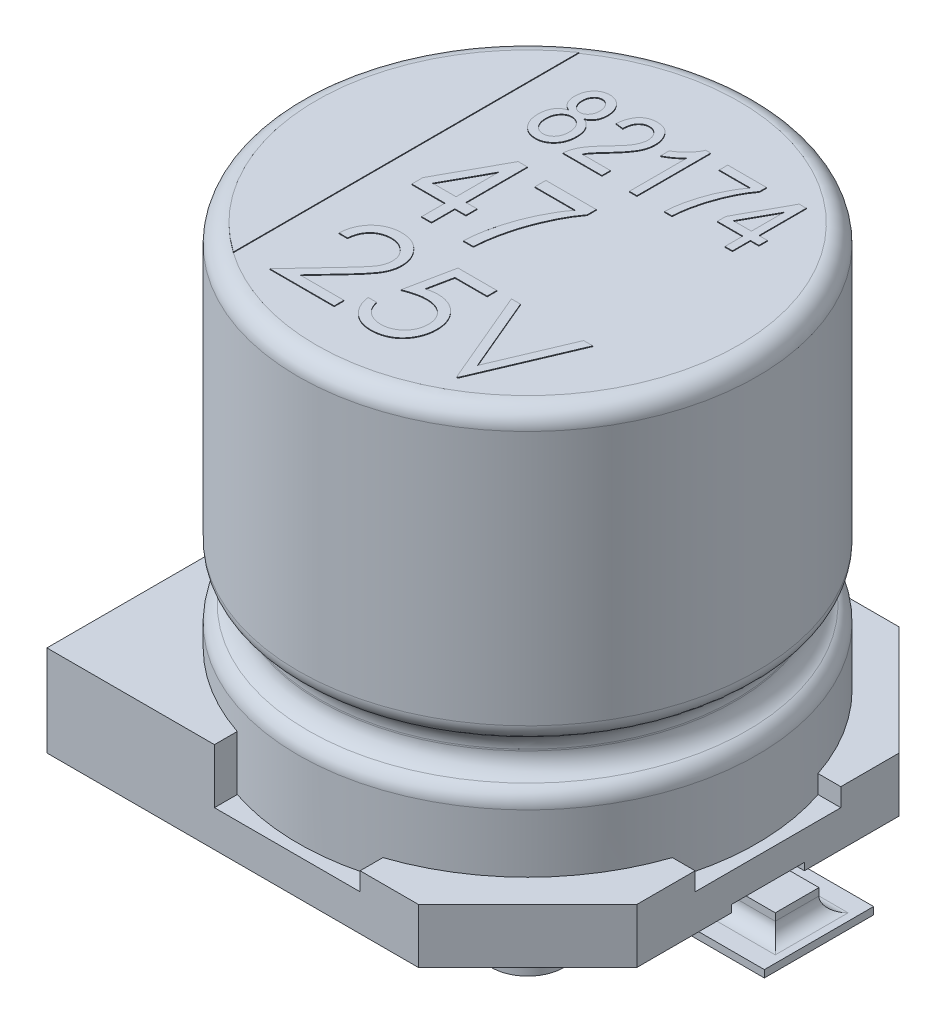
from build123d import *

# Parameters (mm, degrees)
ESQUISSE1_R             = 3.15
BOSS_EXTRU_1_DEPTH      = 1.3
CONG_1_R                = 0.25
ESQUISSE2_R             = 2.85
BOSS_EXTRU_2_DEPTH      = 0.5
CONG_2_R                = 0.3
ESQUISSE3_R             = 3.15
BOSS_EXTRU_3_DEPTH      = 4
CONG_3_R                = 0.25
CONG_4_R                = 0.3
CONG_5_R                = 0.25
BOSS_EXTRU_4_DEPTH      = 0.5
BOSS_EXTRU_5_DEPTH      = 0.25
BOSS_EXTRU_6_DEPTH      = 0.75
ESQUISSE7_R             = 0.5
BOSS_EXTRU_7_DEPTH      = 0.3
ENL_V_MAT_EXTRU_1_DEPTH = 0.1
BOSS_EXTRU_8_DEPTH      = 0.3
ESQUISSE10_W            = 2
ESQUISSE10_H            = 1.5
BOSS_EXTRU_9_DEPTH      = 0.1
CONG_6_R                = 0.2
BOSS_EXTRU_10_DEPTH     = 0.1
BOSS_EXTRU_11_DEPTH     = 0.01


with BuildPart() as part:
    # Esquisse1 → Boss.-Extru.1 (new body)
    with BuildSketch(Plane(origin=(0, 0, 0), x_dir=(1, 0, 0), z_dir=(0, 1, 0))):
        with Locations(Location((0, 0, 0), (0, 0, 270))):
            Circle(ESQUISSE1_R)
    extrude(amount=BOSS_EXTRU_1_DEPTH)

    # Cong_1
    cong_1_edges = [part.edges().sort_by_distance(p)[0] for p in [
        (0, 1.3, -3.15),
    ]]
    fillet(cong_1_edges, radius=CONG_1_R)

    # Esquisse2 → Boss.-Extru.2 (add)
    with BuildSketch(Plane(origin=(0, 1.3, 0), x_dir=(1, 0, 0), z_dir=(0, 1, 0))):
        with Locations(Location((0, 0, 0), (0, 0, 270))):
            Circle(ESQUISSE2_R)
    extrude(amount=BOSS_EXTRU_2_DEPTH)

    # Cong_2
    cong_2_edges = [part.edges().sort_by_distance(p)[0] for p in [
        (0, 1.3, -2.85),
    ]]
    fillet(cong_2_edges, radius=CONG_2_R)

    # Esquisse3 → Boss.-Extru.3 (add)
    with BuildSketch(Plane(origin=(0, 1.8, 0), x_dir=(1, 0, 0), z_dir=(0, 1, 0))):
        with Locations(Location((0, 0, 0), (0, 0, 270))):
            Circle(ESQUISSE3_R)
    extrude(amount=BOSS_EXTRU_3_DEPTH)

    # Cong_3
    cong_3_edges = [part.edges().sort_by_distance(p)[0] for p in [
        (0, 1.8, -3.15),
    ]]
    fillet(cong_3_edges, radius=CONG_3_R)

    # Cong_4
    cong_4_edges = [part.edges().sort_by_distance(p)[0] for p in [
        (0, 1.8, -2.85),
    ]]
    fillet(cong_4_edges, radius=CONG_4_R)

    # Cong_5
    cong_5_edges = [part.edges().sort_by_distance(p)[0] for p in [
        (0, 5.8, -3.15),
    ]]
    fillet(cong_5_edges, radius=CONG_5_R)

    # Esquisse4 → Boss.-Extru.4 (add)
    with BuildSketch(Plane.XZ):
        Polygon((1.8, -3.3), (3.3, -1.8), (3.3, 1.8), (1.8, 3.3), (-3.3, 3.3), (-3.3, -3.3), align=None)
    extrude(amount=BOSS_EXTRU_4_DEPTH)

    # Esquisse5 → Boss.-Extru.5 (add)
    with BuildSketch(Plane(origin=(0, 0, 0), x_dir=(1, 0, 0), z_dir=(0, 1, 0))):
        with BuildLine():
            Line((1.8, 3.3), (1, 3.3))
            Line((1, 3.3), (1, 2.987055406))
            ThreePointArc((1, 2.987055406), (2.227386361, 2.227386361), (2.987055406, 1))
            Line((2.987055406, 1), (3.3, 1))
            Line((3.3, 1), (3.3, 1.8))
            Line((3.3, 1.8), (1.8, 3.3))
        make_face()
        with BuildLine():
            Line((1, -3.3), (1.8, -3.3))
            Line((1.8, -3.3), (3.3, -1.8))
            Line((3.3, -1.8), (3.3, -1))
            Line((3.3, -1), (2.987055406, -1))
            ThreePointArc((2.987055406, -1), (2.227386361, -2.227386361), (1, -2.987055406))
            Line((1, -2.987055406), (1, -3.3))
        make_face()
    extrude(amount=BOSS_EXTRU_5_DEPTH)

    # Esquisse6 → Boss.-Extru.6 (add)
    with BuildSketch(Plane(origin=(0, 0, 0), x_dir=(1, 0, 0), z_dir=(0, 1, 0))):
        with BuildLine():
            Line((-1, 3.3), (-3.3, 3.3))
            Line((-3.3, 3.3), (-3.3, 1))
            Line((-3.3, 1), (-2.987055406, 1))
            ThreePointArc((-2.987055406, 1), (-2.227386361, 2.227386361), (-1, 2.987055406))
            Line((-1, 2.987055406), (-1, 3.3))
        make_face()
        with BuildLine():
            Line((-1, -2.987055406), (-1, -3.3))
            Line((-1, -3.3), (-3.3, -3.3))
            Line((-3.3, -3.3), (-3.3, -1))
            Line((-3.3, -1), (-2.987055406, -1))
            ThreePointArc((-2.987055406, -1), (-2.227386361, -2.227386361), (-1, -2.987055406))
        make_face()
    extrude(amount=BOSS_EXTRU_6_DEPTH)

    # Esquisse7 → Boss.-Extru.7 (add)
    with BuildSketch(Plane.XZ.offset(0.5)):
        with Locations(Location((-2, 2, 0), (0, 0, 270))):
            Circle(ESQUISSE7_R)
        with Locations(Location((2, 2, 0), (0, 0, 270))):
            Circle(ESQUISSE7_R)
        with Locations(Location((2, -2, 0), (0, 0, 270))):
            Circle(ESQUISSE7_R)
        with Locations(Location((-2, -2, 0), (0, 0, 270))):
            Circle(ESQUISSE7_R)
    extrude(amount=BOSS_EXTRU_7_DEPTH)

    # Esquisse8 → Enl_v. mat.-Extru.1 (cut)
    with BuildSketch(Plane.XZ.offset(0.5)):
        with BuildLine():
            Line((-1.8, 0.5), (-3.3, 0.5))
            Line((-3.3, 0.5), (-3.3, -0.5))
            Line((-3.3, -0.5), (-1.8, -0.5))
            ThreePointArc((-1.8, -0.5), (-1.3, 0), (-1.8, 0.5))
        make_face()
        with BuildLine():
            Line((1.8, -0.5), (3.3, -0.5))
            Line((3.3, -0.5), (3.3, 0.5))
            Line((3.3, 0.5), (1.8, 0.5))
            ThreePointArc((1.8, 0.5), (1.3, 0), (1.8, -0.5))
        make_face()
    extrude(amount=-ENL_V_MAT_EXTRU_1_DEPTH, mode=Mode.SUBTRACT)

    # Esquisse9 → Boss.-Extru.8 (add)
    with BuildSketch(Plane.XZ.offset(0.4)):
        with BuildLine():
            Line((-1.8, 0.3), (-3.7, 0.3))
            Line((-3.7, 0.3), (-3.7, -0.3))
            Line((-3.7, -0.3), (-1.8, -0.3))
            ThreePointArc((-1.8, -0.3), (-1.5, 0), (-1.8, 0.3))
        make_face()
        with BuildLine():
            Line((1.8, 0.3), (3.7, 0.3))
            Line((3.7, 0.3), (3.7, -0.3))
            Line((3.7, -0.3), (1.8, -0.3))
            ThreePointArc((1.8, -0.3), (1.5, 0), (1.8, 0.3))
        make_face()
    extrude(amount=BOSS_EXTRU_8_DEPTH)

    # Esquisse10 → Boss.-Extru.9 (add)
    with BuildSketch(Plane.XZ.offset(0.7)):
        with Locations((-3, 0)):
            Rectangle(ESQUISSE10_W, ESQUISSE10_H)
        with Locations((3, 0)):
            Rectangle(ESQUISSE10_W, ESQUISSE10_H)
    extrude(amount=BOSS_EXTRU_9_DEPTH)

    # Cong_6
    cong_6_edges = [part.edges().sort_by_distance(p)[0] for p in [
        (-3.7, -0.7, 0),
        (-2.85, -0.7, -0.3),
        (3.7, -0.7, 0),
        (2.85, -0.7, 0.3),
        (-2.85, -0.7, 0.3),
        (2.85, -0.7, -0.3),
    ]]
    fillet(cong_6_edges, radius=CONG_6_R)

    # Esquisse11 → Boss.-Extru.10 (add)
    with BuildSketch(Plane.XZ.offset(0.7)):
        with BuildLine():
            Line((-1.8, 0.3), (-2, 0.3))
            Line((-2, 0.3), (-2, -0.3))
            Line((-2, -0.3), (-1.8, -0.3))
            ThreePointArc((-1.8, -0.3), (-1.5, 0), (-1.8, 0.3))
        make_face()
        with BuildLine():
            Line((2, 0.3), (1.8, 0.3))
            ThreePointArc((1.8, 0.3), (1.5, 0), (1.8, -0.3))
            Line((1.8, -0.3), (2, -0.3))
            Line((2, -0.3), (2, 0.3))
        make_face()
    extrude(amount=BOSS_EXTRU_10_DEPTH)

    # Esquisse12 → Boss.-Extru.11 (add)
    # profile 1 of 11: a face of its own
    with BuildSketch(Plane(origin=(0, 5.8, 0), x_dir=(1, 0, 0), z_dir=(0, 1, 0))):
        with BuildLine():
            Line((-1.668046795, 2.372260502), (-1.668046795, -2.372260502))
            ThreePointArc((-1.668046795, -2.372260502), (-2.9, 0), (-1.668046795, 2.372260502))
        make_face()
    # profile 2 of 11: a face of its own
    with BuildSketch(Plane(origin=(0, 5.8, 0), x_dir=(1, 0, 0), z_dir=(0, 1, 0))):
        with BuildLine():
            add(Edge.make_bspline(
                [(-1.055587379, 1.616338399), (-1.065146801, 1.621142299), (-1.083797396, 1.63051479), (-1.108656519, 1.64887278), (-1.129854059, 1.670192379), (-1.147315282, 1.694627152), (-1.160825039, 1.722200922), (-1.170217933, 1.752816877), (-1.176325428, 1.786415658), (-1.176859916, 1.809897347), (-1.177137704, 1.822101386)],
                knots=[0, 0, 0, 0, 1.008302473, 1.967215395, 2.901654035, 3.835241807, 4.788827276, 5.786238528, 6.849451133, 8, 8, 8, 8], degree=3))
            add(Edge.make_bspline(
                [(-1.177137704, 1.822101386), (-1.176951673, 1.831444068), (-1.176588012, 1.849707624), (-1.173484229, 1.876456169), (-1.168386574, 1.901813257), (-1.16163767, 1.925965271), (-1.152300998, 1.948544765), (-1.141414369, 1.970085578), (-1.128127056, 1.990108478), (-1.113190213, 2.00879555), (-1.096613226, 2.025537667), (-1.078895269, 2.040254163), (-1.060093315, 2.052788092), (-1.040167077, 2.062892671), (-1.019299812, 2.070891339), (-0.997408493, 2.076654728), (-0.974444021, 2.079829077), (-0.958802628, 2.080356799), (-0.950879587, 2.080624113)],
                knots=[0, 0, 0, 0, 1.165528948, 2.278436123, 3.35437051, 4.390847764, 5.401785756, 6.398351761, 7.397951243, 8.394481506, 9.379254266, 10.332413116, 11.264104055, 12.192693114, 13.114390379, 14.047914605, 15.011184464, 16, 16, 16, 16], degree=3))
            add(Edge.make_bspline(
                [(-0.950879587, 2.080624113), (-0.942885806, 2.080379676), (-0.927093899, 2.079896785), (-0.903964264, 2.07639), (-0.881859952, 2.07068871), (-0.860780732, 2.06276479), (-0.840760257, 2.052329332), (-0.821927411, 2.039481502), (-0.804048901, 2.024459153), (-0.787363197, 2.007360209), (-0.772218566, 1.98838099), (-0.759017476, 1.967932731), (-0.747470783, 1.946385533), (-0.738394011, 1.923263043), (-0.731265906, 1.898809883), (-0.726269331, 1.872996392), (-0.72314429, 1.845920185), (-0.722778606, 1.827453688), (-0.722592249, 1.818042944)],
                knots=[0, 0, 0, 0, 0.985268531, 1.946421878, 2.87680472, 3.795226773, 4.71648376, 5.65319809, 6.600248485, 7.590936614, 8.593729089, 9.588305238, 10.588007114, 11.602279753, 12.644649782, 13.724021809, 14.840134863, 16, 16, 16, 16], degree=3))
            add(Edge.make_bspline(
                [(-0.722592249, 1.818042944), (-0.722888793, 1.806313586), (-0.723460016, 1.783719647), (-0.729351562, 1.751271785), (-0.738523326, 1.721523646), (-0.751877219, 1.694642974), (-0.768947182, 1.670489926), (-0.789910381, 1.649300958), (-0.814556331, 1.630603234), (-0.833281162, 1.621187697), (-0.842925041, 1.616338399)],
                knots=[0, 0, 0, 0, 1.126288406, 2.16953834, 3.158564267, 4.109347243, 5.041996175, 5.989081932, 6.964313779, 8, 8, 8, 8], degree=3))
            add(Edge.make_bspline(
                [(-0.842925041, 1.616338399), (-0.836655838, 1.613802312), (-0.824241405, 1.608780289), (-0.806660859, 1.599566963), (-0.790075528, 1.589471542), (-0.774851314, 1.577978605), (-0.760532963, 1.565579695), (-0.747308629, 1.551978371), (-0.735339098, 1.537132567), (-0.724605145, 1.521182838), (-0.714698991, 1.504363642), (-0.706551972, 1.486250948), (-0.699307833, 1.467330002), (-0.693713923, 1.447333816), (-0.689230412, 1.426392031), (-0.686057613, 1.404494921), (-0.68389742, 1.381600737), (-0.683721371, 1.366005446), (-0.68363121, 1.358018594)],
                knots=[0, 0, 0, 0, 0.998518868, 1.977292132, 2.928488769, 3.863806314, 4.791620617, 5.724425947, 6.662355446, 7.604692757, 8.562792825, 9.541974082, 10.534927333, 11.553397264, 12.605860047, 13.696849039, 14.820482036, 16, 16, 16, 16], degree=3))
            add(Edge.make_bspline(
                [(-0.68363121, 1.358018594), (-0.683882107, 1.347121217), (-0.684374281, 1.325744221), (-0.687730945, 1.294408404), (-0.693955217, 1.264653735), (-0.702142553, 1.236328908), (-0.713003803, 1.209671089), (-0.726005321, 1.184418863), (-0.741720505, 1.160912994), (-0.759533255, 1.139045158), (-0.779005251, 1.119293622), (-0.799924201, 1.102080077), (-0.821896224, 1.087368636), (-0.845123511, 1.075245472), (-0.869667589, 1.066231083), (-0.895166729, 1.059354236), (-0.921883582, 1.055557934), (-0.940046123, 1.054955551), (-0.94925621, 1.054650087)],
                knots=[0, 0, 0, 0, 1.159749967, 2.275040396, 3.347967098, 4.391166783, 5.408413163, 6.406504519, 7.408740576, 8.411571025, 9.404143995, 10.355316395, 11.289670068, 12.213679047, 13.136228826, 14.066859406, 15.019719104, 16, 16, 16, 16], degree=3))
            add(Edge.make_bspline(
                [(-0.94925621, 1.054650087), (-0.958601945, 1.054952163), (-0.976967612, 1.055545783), (-1.003948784, 1.059362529), (-1.029603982, 1.066184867), (-1.054237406, 1.075304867), (-1.077604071, 1.087295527), (-1.099610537, 1.102155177), (-1.120725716, 1.119213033), (-1.140162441, 1.139072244), (-1.158120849, 1.160863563), (-1.17343346, 1.184759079), (-1.186845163, 1.2100568), (-1.19753548, 1.237166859), (-1.20589234, 1.265904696), (-1.211666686, 1.29634997), (-1.215444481, 1.328364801), (-1.215877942, 1.35029649), (-1.216098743, 1.361468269)],
                knots=[0, 0, 0, 0, 0.984972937, 1.935608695, 2.864070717, 3.777636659, 4.698984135, 5.624239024, 6.571662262, 7.554569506, 8.54763434, 9.542156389, 10.540146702, 11.560717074, 12.60743999, 13.689489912, 14.823049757, 16, 16, 16, 16], degree=3))
            add(Edge.make_bspline(
                [(-1.216098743, 1.361468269), (-1.216000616, 1.369656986), (-1.215808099, 1.385722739), (-1.213742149, 1.409314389), (-1.210298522, 1.431807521), (-1.205649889, 1.453166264), (-1.199785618, 1.473411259), (-1.192464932, 1.492556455), (-1.183751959, 1.510601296), (-1.17373316, 1.527542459), (-1.162649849, 1.543323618), (-1.150444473, 1.557807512), (-1.137149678, 1.570862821), (-1.122887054, 1.582660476), (-1.107633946, 1.593340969), (-1.091181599, 1.602367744), (-1.073810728, 1.61019835), (-1.061713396, 1.614274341), (-1.055587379, 1.616338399)],
                knots=[0, 0, 0, 0, 1.21084686, 2.375606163, 3.49898943, 4.574306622, 5.606312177, 6.613285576, 7.602106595, 8.566331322, 9.521116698, 10.451051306, 11.363604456, 12.273026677, 13.186018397, 14.112988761, 15.044428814, 16, 16, 16, 16], degree=3))
        make_face()
        with BuildLine():
            add(Edge.make_bspline(
                [(-1.0732416, 1.824942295), (-1.072851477, 1.81334219), (-1.072105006, 1.79114627), (-1.065405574, 1.759588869), (-1.053994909, 1.731789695), (-1.038375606, 1.70801204), (-1.019267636, 1.689141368), (-0.997955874, 1.674973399), (-0.974221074, 1.666457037), (-0.957642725, 1.665515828), (-0.94925621, 1.665039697)],
                knots=[0, 0, 0, 0, 1.231806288, 2.356967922, 3.407623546, 4.408504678, 5.359070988, 6.242373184, 7.110866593, 8, 8, 8, 8], degree=3))
            add(Edge.make_bspline(
                [(-0.94925621, 1.665039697), (-0.940997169, 1.665505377), (-0.924666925, 1.666426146), (-0.901441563, 1.67509991), (-0.880169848, 1.688664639), (-0.861495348, 1.707433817), (-0.845866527, 1.730381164), (-0.834414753, 1.756934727), (-0.827646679, 1.786661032), (-0.826884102, 1.807454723), (-0.826488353, 1.818245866)],
                knots=[0, 0, 0, 0, 0.904069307, 1.787576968, 2.686104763, 3.657927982, 4.673759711, 5.718490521, 6.815982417, 8, 8, 8, 8], degree=3))
            add(Edge.make_bspline(
                [(-0.826488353, 1.818245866), (-0.826868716, 1.829377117), (-0.827602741, 1.850858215), (-0.834574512, 1.881456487), (-0.846261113, 1.908901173), (-0.862531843, 1.932427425), (-0.88148921, 1.951986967), (-0.902847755, 1.966199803), (-0.926059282, 1.975130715), (-0.942279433, 1.976191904), (-0.950473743, 1.976728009)],
                knots=[0, 0, 0, 0, 1.195037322, 2.306184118, 3.351541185, 4.382027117, 5.363972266, 6.261309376, 7.121625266, 8, 8, 8, 8], degree=3))
            add(Edge.make_bspline(
                [(-0.950473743, 1.976728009), (-0.958662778, 1.976257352), (-0.974856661, 1.975326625), (-0.998050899, 1.966674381), (-1.019190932, 1.952594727), (-1.037891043, 1.933562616), (-1.053863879, 1.910787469), (-1.064920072, 1.884470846), (-1.072170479, 1.855633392), (-1.072876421, 1.835405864), (-1.0732416, 1.824942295)],
                knots=[0, 0, 0, 0, 0.904281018, 1.788222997, 2.702503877, 3.698439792, 4.727116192, 5.763971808, 6.843317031, 8, 8, 8, 8], degree=3))
        make_face(mode=Mode.SUBTRACT)
        with BuildLine():
            add(Edge.make_bspline(
                [(-1.112202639, 1.361874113), (-1.112039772, 1.354427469), (-1.111720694, 1.339838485), (-1.109434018, 1.318546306), (-1.105904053, 1.298347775), (-1.100521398, 1.279373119), (-1.093879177, 1.26138562), (-1.085544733, 1.244539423), (-1.075697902, 1.228820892), (-1.064697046, 1.214213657), (-1.052266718, 1.201417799), (-1.039448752, 1.189838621), (-1.025939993, 1.180110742), (-1.011676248, 1.172263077), (-0.996874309, 1.16623156), (-0.981538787, 1.161669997), (-0.965587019, 1.158956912), (-0.954745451, 1.158684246), (-0.94925621, 1.158546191)],
                knots=[0, 0, 0, 0, 1.229957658, 2.409653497, 3.534020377, 4.613053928, 5.663236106, 6.697665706, 7.711552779, 8.723960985, 9.711901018, 10.6537745, 11.574735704, 12.45493582, 13.336836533, 14.210201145, 15.093799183, 16, 16, 16, 16], degree=3))
            add(Edge.make_bspline(
                [(-0.94925621, 1.158546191), (-0.943697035, 1.158673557), (-0.932783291, 1.158923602), (-0.916748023, 1.161761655), (-0.901344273, 1.165924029), (-0.88659769, 1.171913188), (-0.872461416, 1.179447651), (-0.859075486, 1.188820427), (-0.846384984, 1.199993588), (-0.834273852, 1.21257193), (-0.823467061, 1.22685147), (-0.813478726, 1.241978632), (-0.805777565, 1.258660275), (-0.798851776, 1.276121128), (-0.793991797, 1.294967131), (-0.789926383, 1.314844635), (-0.788107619, 1.336002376), (-0.787723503, 1.350441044), (-0.787527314, 1.357815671)],
                knots=[0, 0, 0, 0, 0.929108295, 1.824020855, 2.716353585, 3.594799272, 4.480866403, 5.391315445, 6.321801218, 7.306391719, 8.306918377, 9.31465165, 10.332061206, 11.374528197, 12.453461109, 13.583192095, 14.765602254, 16, 16, 16, 16], degree=3))
            add(Edge.make_bspline(
                [(-0.787527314, 1.357815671), (-0.78769699, 1.365261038), (-0.788029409, 1.37984752), (-0.790221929, 1.401169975), (-0.794094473, 1.421316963), (-0.799391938, 1.440320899), (-0.80606566, 1.458299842), (-0.814375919, 1.475195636), (-0.824367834, 1.490872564), (-0.835791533, 1.505224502), (-0.8479979, 1.518342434), (-0.861025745, 1.529807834), (-0.874748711, 1.539385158), (-0.888964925, 1.547423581), (-0.903875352, 1.553447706), (-0.919267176, 1.5580499), (-0.935363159, 1.560727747), (-0.946337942, 1.561003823), (-0.951894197, 1.561143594)],
                knots=[0, 0, 0, 0, 1.22586307, 2.401631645, 3.524301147, 4.599742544, 5.646428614, 6.677414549, 7.693861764, 8.700930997, 9.693673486, 10.640764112, 11.552218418, 12.444626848, 13.323591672, 14.194048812, 15.08569251, 16, 16, 16, 16], degree=3))
            add(Edge.make_bspline(
                [(-0.951894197, 1.561143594), (-0.95738219, 1.561002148), (-0.968221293, 1.560722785), (-0.984126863, 1.558069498), (-0.99925176, 1.553382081), (-1.014032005, 1.547733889), (-1.027840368, 1.539491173), (-1.04134625, 1.530085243), (-1.053888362, 1.518519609), (-1.06584907, 1.50562245), (-1.076722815, 1.491284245), (-1.086339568, 1.475844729), (-1.094256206, 1.459269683), (-1.100698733, 1.441708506), (-1.106074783, 1.423236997), (-1.109690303, 1.40366192), (-1.11165231, 1.383086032), (-1.112016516, 1.369048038), (-1.112202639, 1.361874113)],
                knots=[0, 0, 0, 0, 0.923472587, 1.823911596, 2.703001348, 3.586871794, 4.479500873, 5.402130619, 6.35347509, 7.344669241, 8.360414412, 9.377945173, 10.401637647, 11.446516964, 12.524200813, 13.636404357, 14.792116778, 16, 16, 16, 16], degree=3))
        make_face(mode=Mode.SUBTRACT)
    # profile 3 of 11: a face of its own
    with BuildSketch(Plane(origin=(0, 5.8, 0), x_dir=(1, 0, 0), z_dir=(0, 1, 0))):
        with BuildLine():
            Line((-0.047267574, 1.184520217), (-0.047267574, 1.0676371))
            Line((-0.047267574, 1.0676371), (-0.579735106, 1.0676371))
            add(Edge.make_bspline(
                [(-0.579735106, 1.0676371), (-0.57975976, 1.073727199), (-0.579809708, 1.08606584), (-0.578149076, 1.104877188), (-0.574737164, 1.124143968), (-0.5703805, 1.144123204), (-0.564203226, 1.164552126), (-0.556641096, 1.185529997), (-0.547718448, 1.20700459), (-0.537270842, 1.229103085), (-0.525062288, 1.252037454), (-0.510330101, 1.275711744), (-0.493399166, 1.300550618), (-0.474247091, 1.326402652), (-0.452499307, 1.353022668), (-0.42880131, 1.380805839), (-0.402814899, 1.409694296), (-0.38431252, 1.428893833), (-0.374783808, 1.438781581)],
                knots=[0, 0, 0, 0, 0.672188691, 1.361865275, 2.08134618, 2.831455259, 3.618325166, 4.435686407, 5.292818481, 6.184803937, 7.133719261, 8.159707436, 9.261705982, 10.452168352, 11.710682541, 13.056179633, 14.483934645, 16, 16, 16, 16], degree=3))
            add(Edge.make_bspline(
                [(-0.374783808, 1.438781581), (-0.363710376, 1.450235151), (-0.342389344, 1.472288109), (-0.312382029, 1.504850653), (-0.285117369, 1.535117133), (-0.261140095, 1.563634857), (-0.240024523, 1.590015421), (-0.221558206, 1.614221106), (-0.20662365, 1.636801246), (-0.190498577, 1.663370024), (-0.17512561, 1.694999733), (-0.161535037, 1.731869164), (-0.152753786, 1.767510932), (-0.151683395, 1.79100879), (-0.151163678, 1.802417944)],
                knots=[0, 0, 0, 0, 1.312560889, 2.527233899, 3.64818266, 4.668586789, 5.596397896, 6.432357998, 7.175835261, 7.825761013, 8.992224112, 10.065918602, 11.060925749, 12, 12, 12, 12], degree=3))
            add(Edge.make_bspline(
                [(-0.151163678, 1.802417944), (-0.151236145, 1.808716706), (-0.151377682, 1.821018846), (-0.153782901, 1.838984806), (-0.157213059, 1.856073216), (-0.161741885, 1.872407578), (-0.168163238, 1.887719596), (-0.175857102, 1.902115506), (-0.184869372, 1.915660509), (-0.19515374, 1.928155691), (-0.206495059, 1.939427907), (-0.218447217, 1.949554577), (-0.231321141, 1.957750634), (-0.24458771, 1.964885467), (-0.258695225, 1.970056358), (-0.273346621, 1.973997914), (-0.28867745, 1.976220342), (-0.299087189, 1.976557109), (-0.304369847, 1.976728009)],
                knots=[0, 0, 0, 0, 1.164486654, 2.274364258, 3.346924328, 4.388668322, 5.404300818, 6.412115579, 7.404820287, 8.409522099, 9.400647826, 10.360464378, 11.301161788, 12.219192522, 13.141987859, 14.073903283, 15.022558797, 16, 16, 16, 16], degree=3))
            add(Edge.make_bspline(
                [(-0.304369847, 1.976728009), (-0.310065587, 1.976608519), (-0.321183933, 1.97637527), (-0.337389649, 1.97347661), (-0.3529177, 1.969598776), (-0.367689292, 1.963584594), (-0.381596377, 1.955880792), (-0.394839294, 1.946607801), (-0.407158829, 1.935590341), (-0.41880315, 1.923062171), (-0.42901088, 1.908776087), (-0.438383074, 1.893316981), (-0.445763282, 1.876030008), (-0.452038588, 1.857448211), (-0.45695314, 1.837354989), (-0.460238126, 1.81582612), (-0.462647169, 1.792866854), (-0.46278246, 1.777059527), (-0.462851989, 1.768935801)],
                knots=[0, 0, 0, 0, 0.928788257, 1.813037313, 2.680996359, 3.53827917, 4.408273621, 5.272359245, 6.172129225, 7.102295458, 8.058839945, 9.034325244, 10.048074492, 11.120300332, 12.234644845, 13.420320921, 14.674247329, 16, 16, 16, 16], degree=3))
            Line((-0.462851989, 1.768935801), (-0.566748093, 1.781922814))
            add(Edge.make_bspline(
                [(-0.566748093, 1.781922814), (-0.565677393, 1.793979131), (-0.563600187, 1.817368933), (-0.558150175, 1.851229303), (-0.550587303, 1.882645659), (-0.541609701, 1.91193142), (-0.530314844, 1.938723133), (-0.517686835, 1.963508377), (-0.502719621, 1.985748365), (-0.486028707, 2.005718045), (-0.467753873, 2.023435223), (-0.44799812, 2.038728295), (-0.426788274, 2.051620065), (-0.404366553, 2.062459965), (-0.380269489, 2.07055472), (-0.354929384, 2.076429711), (-0.328140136, 2.079910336), (-0.309858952, 2.080382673), (-0.300514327, 2.080624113)],
                knots=[0, 0, 0, 0, 1.296155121, 2.514599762, 3.669097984, 4.755193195, 5.79120272, 6.77953026, 7.729955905, 8.65570694, 9.562583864, 10.450894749, 11.325630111, 12.216772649, 13.112585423, 14.04224033, 14.999270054, 16, 16, 16, 16], degree=3))
            add(Edge.make_bspline(
                [(-0.300514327, 2.080624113), (-0.290424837, 2.080327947), (-0.270778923, 2.079751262), (-0.242179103, 2.07595137), (-0.215504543, 2.069248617), (-0.190636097, 2.059921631), (-0.167872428, 2.047642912), (-0.146843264, 2.032914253), (-0.127899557, 2.015287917), (-0.111041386, 1.995231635), (-0.096143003, 1.97357847), (-0.08314319, 1.950936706), (-0.071866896, 1.927681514), (-0.063054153, 1.903554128), (-0.055694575, 1.878878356), (-0.051071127, 1.853280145), (-0.047816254, 1.827054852), (-0.0474515, 1.809327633), (-0.047267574, 1.800388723)],
                knots=[0, 0, 0, 0, 1.141256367, 2.222215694, 3.255808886, 4.246221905, 5.218350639, 6.173592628, 7.142736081, 8.136099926, 9.131465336, 10.11177911, 11.087094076, 12.050634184, 13.014356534, 13.995714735, 14.989343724, 16, 16, 16, 16], degree=3))
            add(Edge.make_bspline(
                [(-0.047267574, 1.800388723), (-0.047440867, 1.792335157), (-0.047785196, 1.776332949), (-0.050025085, 1.752456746), (-0.053978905, 1.728901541), (-0.059112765, 1.705440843), (-0.066397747, 1.682437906), (-0.074644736, 1.659527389), (-0.084647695, 1.636967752), (-0.096456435, 1.614318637), (-0.110282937, 1.590778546), (-0.126851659, 1.565917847), (-0.145855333, 1.539072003), (-0.168065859, 1.510719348), (-0.192407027, 1.480044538), (-0.219954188, 1.44782049), (-0.250169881, 1.413763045), (-0.271457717, 1.390653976), (-0.282454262, 1.378716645)],
                knots=[0, 0, 0, 0, 0.78053567, 1.550902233, 2.321464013, 3.094364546, 3.87611052, 4.657966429, 5.453363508, 6.265521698, 7.132350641, 8.097801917, 9.160103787, 10.319208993, 11.587678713, 12.955014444, 14.427067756, 16, 16, 16, 16], degree=3))
            add(Edge.make_bspline(
                [(-0.282454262, 1.378716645), (-0.289435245, 1.371289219), (-0.302776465, 1.357094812), (-0.32166923, 1.336555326), (-0.338622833, 1.317870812), (-0.354006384, 1.301304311), (-0.367059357, 1.286298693), (-0.378376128, 1.273250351), (-0.387622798, 1.261998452), (-0.401480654, 1.244309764), (-0.418959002, 1.219386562), (-0.431034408, 1.195890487), (-0.436877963, 1.184520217)],
                knots=[0, 0, 0, 0, 1.227496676, 2.345844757, 3.360613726, 4.265798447, 5.068085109, 5.75545707, 6.345771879, 6.821573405, 8.46188917, 10, 10, 10, 10], degree=3))
            Line((-0.436877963, 1.184520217), (-0.047267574, 1.184520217))
        make_face()
    # profile 4 of 11: a face of its own
    with BuildSketch(Plane(origin=(0, 5.8, 0), x_dir=(1, 0, 0), z_dir=(0, 1, 0))):
        with BuildLine():
            Line((0.433251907, 1.0676371), (0.329355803, 1.0676371))
            Line((0.329355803, 1.0676371), (0.329355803, 1.859844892))
            add(Edge.make_bspline(
                [(0.329355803, 1.859844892), (0.322975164, 1.852500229), (0.309751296, 1.837278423), (0.286795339, 1.815630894), (0.261213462, 1.793307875), (0.232890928, 1.77164666), (0.204032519, 1.750898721), (0.175529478, 1.732650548), (0.148450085, 1.716773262), (0.130283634, 1.708143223), (0.121563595, 1.704000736)],
                knots=[0, 0, 0, 0, 0.892555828, 1.849821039, 2.893015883, 4.008277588, 5.121255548, 6.154629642, 7.114207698, 8, 8, 8, 8], degree=3))
            Line((0.121563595, 1.704000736), (0.121563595, 1.820883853))
            add(Edge.make_bspline(
                [(0.121563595, 1.820883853), (0.135577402, 1.829317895), (0.163485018, 1.846113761), (0.202587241, 1.875209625), (0.239526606, 1.906613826), (0.273199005, 1.94065541), (0.303348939, 1.975747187), (0.329227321, 2.010768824), (0.350445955, 2.045348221), (0.360854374, 2.069134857), (0.365881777, 2.080624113)],
                knots=[0, 0, 0, 0, 1.082272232, 2.155277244, 3.222407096, 4.289527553, 5.32168536, 6.282742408, 7.170542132, 8, 8, 8, 8], degree=3))
            Line((0.365881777, 2.080624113), (0.433251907, 2.080624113))
            Line((0.433251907, 2.080624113), (0.433251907, 1.0676371))
        make_face()
    # profile 5 of 11: a face of its own
    with BuildSketch(Plane(origin=(0, 5.8, 0), x_dir=(1, 0, 0), z_dir=(0, 1, 0))):
        with BuildLine():
            Line((0.692992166, 1.93776697), (0.692992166, 2.054650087))
            Line((0.692992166, 2.054650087), (1.225459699, 2.054650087))
            Line((1.225459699, 2.054650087), (1.225459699, 1.959073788))
            add(Edge.make_bspline(
                [(1.225459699, 1.959073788), (1.215580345, 1.945847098), (1.195471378, 1.918924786), (1.167349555, 1.875859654), (1.139999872, 1.829994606), (1.113396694, 1.781290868), (1.087852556, 1.729591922), (1.063109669, 1.67505993), (1.039399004, 1.617489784), (1.016706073, 1.557613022), (0.995441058, 1.496371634), (0.976606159, 1.434696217), (0.960112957, 1.373182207), (0.946165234, 1.31183242), (0.934278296, 1.250678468), (0.924988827, 1.189613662), (0.917984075, 1.128623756), (0.915174, 1.087942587), (0.913771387, 1.0676371)],
                knots=[0, 0, 0, 0, 0.828235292, 1.685834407, 2.579347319, 3.50739146, 4.469751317, 5.472290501, 6.511687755, 7.593421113, 8.685056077, 9.764080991, 10.828622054, 11.880069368, 12.920502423, 13.954003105, 14.978766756, 16, 16, 16, 16], degree=3))
            Line((0.913771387, 1.0676371), (0.809875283, 1.0676371))
            add(Edge.make_bspline(
                [(0.809875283, 1.0676371), (0.810196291, 1.078328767), (0.810851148, 1.100139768), (0.813478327, 1.133485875), (0.816790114, 1.168227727), (0.821753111, 1.204211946), (0.82785351, 1.241492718), (0.835266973, 1.280022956), (0.843445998, 1.319999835), (0.856542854, 1.374782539), (0.875002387, 1.443402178), (0.901530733, 1.524203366), (0.931437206, 1.603157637), (0.965474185, 1.679253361), (1.001769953, 1.751750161), (1.039992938, 1.819138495), (1.079032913, 1.881302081), (1.107639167, 1.919280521), (1.121563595, 1.93776697)],
                knots=[0, 0, 0, 0, 0.54755489, 1.117011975, 1.712111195, 2.334110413, 2.976306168, 3.645990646, 4.342828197, 5.06521062, 6.529487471, 7.979439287, 9.417531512, 10.850025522, 12.245424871, 13.566691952, 14.815558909, 16, 16, 16, 16], degree=3))
            Line((1.121563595, 1.93776697), (0.692992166, 1.93776697))
        make_face()
    # profile 6 of 11: a face of its own
    with BuildSketch(Plane(origin=(0, 5.8, 0), x_dir=(1, 0, 0), z_dir=(0, 1, 0))):
        Polygon((1.641044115, 1.0676371), (1.641044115, 1.314390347), (1.290394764, 1.314390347), (1.290394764, 1.431273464), (1.646928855, 2.080624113), (1.744940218, 2.080624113), (1.744940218, 1.431273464), (1.861823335, 1.431273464), (1.861823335, 1.314390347), (1.744940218, 1.314390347), (1.744940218, 1.0676371), align=None)
        Polygon((1.641044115, 1.431273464), (1.641044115, 1.883180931), (1.392870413, 1.431273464), align=None, mode=Mode.SUBTRACT)
    # profile 7 of 11: a face of its own
    with BuildSketch(Plane(origin=(0, 5.8, 0), x_dir=(1, 0, 0), z_dir=(0, 1, 0))):
        Polygon((-0.795319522, -0.659530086), (-0.795319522, -0.338750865), (-1.251163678, -0.338750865), (-1.251163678, -0.186802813), (-0.787669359, 0.657353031), (-0.660254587, 0.657353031), (-0.660254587, -0.186802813), (-0.508306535, -0.186802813), (-0.508306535, -0.338750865), (-0.660254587, -0.338750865), (-0.660254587, -0.659530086), align=None)
        Polygon((-0.795319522, -0.186802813), (-0.795319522, 0.400676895), (-1.117945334, -0.186802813), align=None, mode=Mode.SUBTRACT)
    # profile 8 of 11: a face of its own
    with BuildSketch(Plane(origin=(0, 5.8, 0), x_dir=(1, 0, 0), z_dir=(0, 1, 0))):
        with BuildLine():
            Line((-0.3732416, 0.471638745), (-0.3732416, 0.623586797))
            Line((-0.3732416, 0.623586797), (0.318966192, 0.623586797))
            Line((0.318966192, 0.623586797), (0.318966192, 0.499337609))
            add(Edge.make_bspline(
                [(0.318966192, 0.499337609), (0.306123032, 0.482142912), (0.279981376, 0.447143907), (0.243423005, 0.391159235), (0.207868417, 0.331534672), (0.173284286, 0.268219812), (0.140076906, 0.201011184), (0.107911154, 0.130119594), (0.077087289, 0.055278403), (0.047586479, -0.022561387), (0.019941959, -0.102175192), (-0.00454341, -0.182353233), (-0.025984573, -0.262321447), (-0.044116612, -0.342076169), (-0.059569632, -0.421576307), (-0.071645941, -0.500960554), (-0.080752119, -0.580247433), (-0.084405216, -0.633132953), (-0.086228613, -0.659530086)],
                knots=[0, 0, 0, 0, 0.828235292, 1.685834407, 2.579347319, 3.50739146, 4.469751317, 5.472290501, 6.511687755, 7.593421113, 8.685056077, 9.764080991, 10.828622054, 11.880069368, 12.920502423, 13.954003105, 14.978766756, 16, 16, 16, 16], degree=3))
            Line((-0.086228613, -0.659530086), (-0.221293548, -0.659530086))
            add(Edge.make_bspline(
                [(-0.221293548, -0.659530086), (-0.220876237, -0.645630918), (-0.220024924, -0.617276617), (-0.216609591, -0.573926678), (-0.212304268, -0.528762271), (-0.205852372, -0.481982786), (-0.197921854, -0.433517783), (-0.188284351, -0.383428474), (-0.177651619, -0.33145853), (-0.160625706, -0.260241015), (-0.136628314, -0.171035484), (-0.102141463, -0.06599394), (-0.063263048, 0.036646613), (-0.019014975, 0.135571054), (0.028169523, 0.229816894), (0.077859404, 0.317421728), (0.12861137, 0.398234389), (0.165799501, 0.447606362), (0.183901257, 0.471638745)],
                knots=[0, 0, 0, 0, 0.54755489, 1.117011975, 1.712111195, 2.334110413, 2.976306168, 3.645990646, 4.342828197, 5.06521062, 6.529487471, 7.979439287, 9.417531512, 10.850025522, 12.245424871, 13.566691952, 14.815558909, 16, 16, 16, 16], degree=3))
            Line((0.183901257, 0.471638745), (-0.3732416, 0.471638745))
        make_face()
    # profile 9 of 11: a face of its own
    with BuildSketch(Plane(origin=(0, 5.8, 0), x_dir=(1, 0, 0), z_dir=(0, 1, 0))):
        with BuildLine():
            Line((-1.051380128, -1.421108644), (-1.168046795, -1.421108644))
            add(Edge.make_bspline(
                [(-1.168046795, -1.421108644), (-1.167286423, -1.405630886), (-1.165793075, -1.37523298), (-1.15879971, -1.330912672), (-1.148793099, -1.288549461), (-1.134644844, -1.248483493), (-1.117073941, -1.210360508), (-1.096002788, -1.17433193), (-1.071045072, -1.140535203), (-1.042739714, -1.109283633), (-1.011997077, -1.080613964), (-0.978826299, -1.055856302), (-0.943969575, -1.03493831), (-0.907532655, -1.017450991), (-0.869104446, -1.004324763), (-0.82903367, -0.994585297), (-0.787144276, -0.988725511), (-0.758603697, -0.988095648), (-0.744088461, -0.987775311)],
                knots=[0, 0, 0, 0, 1.10065271, 2.161652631, 3.183658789, 4.190468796, 5.17591951, 6.163126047, 7.15150782, 8.156236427, 9.156009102, 10.134482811, 11.092018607, 12.041330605, 13.001268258, 13.972401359, 14.968799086, 16, 16, 16, 16], degree=3))
            add(Edge.make_bspline(
                [(-0.744088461, -0.987775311), (-0.729833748, -0.988109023), (-0.701823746, -0.988764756), (-0.660943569, -0.994395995), (-0.622026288, -1.003215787), (-0.585147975, -1.015590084), (-0.550602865, -1.0322243), (-0.518131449, -1.052206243), (-0.487347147, -1.075316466), (-0.459636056, -1.102525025), (-0.434190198, -1.131571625), (-0.412237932, -1.162581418), (-0.393438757, -1.194609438), (-0.377769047, -1.227899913), (-0.36623391, -1.262766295), (-0.35747629, -1.298700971), (-0.352526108, -1.3360759), (-0.351766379, -1.361372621), (-0.351380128, -1.374233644)],
                knots=[0, 0, 0, 0, 1.111607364, 2.184268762, 3.212621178, 4.221274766, 5.211760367, 6.196651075, 7.1921475, 8.207485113, 9.220403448, 10.201281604, 11.166441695, 12.114753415, 13.065576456, 14.026450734, 14.996634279, 16, 16, 16, 16], degree=3))
            add(Edge.make_bspline(
                [(-0.351380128, -1.374233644), (-0.352009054, -1.392339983), (-0.35325587, -1.428234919), (-0.36392121, -1.480983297), (-0.380578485, -1.532089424), (-0.400634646, -1.573220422), (-0.420867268, -1.606364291), (-0.439099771, -1.633652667), (-0.460443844, -1.663034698), (-0.485210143, -1.694411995), (-0.512886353, -1.728030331), (-0.543723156, -1.763869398), (-0.57794045, -1.801558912), (-0.601956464, -1.827300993), (-0.614400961, -1.840639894)],
                knots=[0, 0, 0, 0, 1.184426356, 2.348067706, 3.509069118, 4.696110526, 5.333549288, 6.050745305, 6.844228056, 7.710549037, 8.667450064, 9.695053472, 10.805634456, 12, 12, 12, 12], degree=3))
            Line((-0.614400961, -1.840639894), (-0.939661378, -2.187775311))
            Line((-0.939661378, -2.187775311), (-0.334713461, -2.187775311))
            Line((-0.334713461, -2.187775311), (-0.334713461, -2.321108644))
            Line((-0.334713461, -2.321108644), (-1.218046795, -2.321108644))
            Line((-1.218046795, -2.321108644), (-0.713880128, -1.783087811))
            add(Edge.make_bspline(
                [(-0.713880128, -1.783087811), (-0.701605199, -1.770274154), (-0.678027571, -1.745661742), (-0.644679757, -1.709728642), (-0.614728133, -1.676393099), (-0.587978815, -1.645718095), (-0.565012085, -1.617254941), (-0.54463097, -1.59192548), (-0.528300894, -1.568616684), (-0.510578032, -1.541598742), (-0.493412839, -1.50861131), (-0.478662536, -1.468298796), (-0.469668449, -1.426800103), (-0.46858951, -1.398756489), (-0.468046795, -1.384650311)],
                knots=[0, 0, 0, 0, 1.329631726, 2.553950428, 3.673215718, 4.687767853, 5.603093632, 6.413772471, 7.123043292, 7.734684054, 8.834405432, 9.900288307, 10.943827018, 12, 12, 12, 12], degree=3))
            add(Edge.make_bspline(
                [(-0.468046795, -1.384650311), (-0.468282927, -1.375780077), (-0.4687483, -1.35829855), (-0.472855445, -1.332667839), (-0.479062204, -1.307943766), (-0.487956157, -1.284050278), (-0.499695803, -1.261227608), (-0.513985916, -1.239447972), (-0.530473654, -1.218392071), (-0.549546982, -1.198649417), (-0.570499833, -1.180567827), (-0.59263484, -1.164550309), (-0.61605345, -1.151164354), (-0.640656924, -1.140191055), (-0.666376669, -1.131583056), (-0.693262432, -1.125618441), (-0.721239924, -1.121873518), (-0.740343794, -1.121366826), (-0.750078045, -1.121108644)],
                knots=[0, 0, 0, 0, 0.991446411, 1.95395049, 2.89581595, 3.838931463, 4.798493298, 5.75982156, 6.748411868, 7.785213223, 8.824556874, 9.840280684, 10.836137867, 11.835679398, 12.848801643, 13.863922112, 14.911575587, 16, 16, 16, 16], degree=3))
            add(Edge.make_bspline(
                [(-0.750078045, -1.121108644), (-0.760244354, -1.121374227), (-0.780209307, -1.121895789), (-0.80952209, -1.125544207), (-0.837485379, -1.131838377), (-0.864169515, -1.140446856), (-0.889619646, -1.151388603), (-0.913712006, -1.165016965), (-0.936392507, -1.181279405), (-0.957703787, -1.199717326), (-0.97733898, -1.220245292), (-0.994590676, -1.243128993), (-1.009664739, -1.267950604), (-1.02281674, -1.294643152), (-1.033497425, -1.323448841), (-1.041658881, -1.354265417), (-1.048116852, -1.386959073), (-1.050274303, -1.409536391), (-1.051380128, -1.421108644)],
                knots=[0, 0, 0, 0, 1.031018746, 2.02475058, 2.990194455, 3.934040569, 4.864654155, 5.795059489, 6.735614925, 7.690564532, 8.649604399, 9.611025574, 10.590972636, 11.591080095, 12.624614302, 13.701020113, 14.821632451, 16, 16, 16, 16], degree=3))
        make_face()
    # profile 10 of 11: a face of its own
    with BuildSketch(Plane(origin=(0, 5.8, 0), x_dir=(1, 0, 0), z_dir=(0, 1, 0))):
        with BuildLine():
            Line((0.598619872, -1.021108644), (0.598619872, -1.154441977))
            Line((0.598619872, -1.154441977), (0.156432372, -1.154441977))
            Line((0.156432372, -1.154441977), (0.086380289, -1.496369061))
            add(Edge.make_bspline(
                [(0.086380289, -1.496369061), (0.100143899, -1.492569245), (0.126808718, -1.485207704), (0.166165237, -1.477034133), (0.203528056, -1.472106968), (0.227773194, -1.471434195), (0.239505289, -1.471108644)],
                knots=[0, 0, 0, 0, 1.100273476, 2.13160584, 3.095893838, 4, 4, 4, 4], degree=3))
            add(Edge.make_bspline(
                [(0.239505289, -1.471108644), (0.254022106, -1.471422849), (0.282565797, -1.472040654), (0.324328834, -1.477973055), (0.364195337, -1.487310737), (0.402081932, -1.500355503), (0.438058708, -1.517036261), (0.471794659, -1.537873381), (0.50379617, -1.562214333), (0.533489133, -1.590199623), (0.560426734, -1.620999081), (0.584111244, -1.654114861), (0.604228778, -1.689225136), (0.620408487, -1.726665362), (0.633328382, -1.766021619), (0.641927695, -1.807708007), (0.647653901, -1.851331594), (0.648293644, -1.881159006), (0.648619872, -1.896369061)],
                knots=[0, 0, 0, 0, 1.052922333, 2.070308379, 3.05430497, 4.020497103, 4.973039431, 5.925935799, 6.892292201, 7.88610001, 8.88166317, 9.857072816, 10.836096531, 11.812156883, 12.81219415, 13.836441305, 14.89672472, 16, 16, 16, 16], degree=3))
            add(Edge.make_bspline(
                [(0.648619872, -1.896369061), (0.648372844, -1.906963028), (0.647882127, -1.928007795), (0.645386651, -1.959261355), (0.640581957, -1.989853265), (0.634131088, -2.019787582), (0.62575819, -2.049007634), (0.615622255, -2.077597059), (0.603218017, -2.105377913), (0.589612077, -2.13261306), (0.574291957, -2.158686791), (0.557288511, -2.1830707), (0.539324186, -2.206130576), (0.519994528, -2.227619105), (0.499119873, -2.247395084), (0.476953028, -2.265575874), (0.453670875, -2.282468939), (0.428913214, -2.297388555), (0.40323172, -2.311117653), (0.376255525, -2.322380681), (0.348598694, -2.332450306), (0.319863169, -2.340476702), (0.290114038, -2.346765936), (0.259302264, -2.351037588), (0.227589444, -2.354148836), (0.206093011, -2.354343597), (0.195234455, -2.354441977)],
                knots=[0, 0, 0, 0, 1.056347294, 2.098418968, 3.122841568, 4.141288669, 5.149314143, 6.15115421, 7.162517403, 8.180376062, 9.185164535, 10.17417709, 11.141909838, 12.097768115, 13.052685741, 14.0056014, 14.954263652, 15.917497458, 16.885230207, 17.854509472, 18.828990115, 19.81800267, 20.826176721, 21.857883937, 22.917946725, 24, 24, 24, 24], degree=3))
            add(Edge.make_bspline(
                [(0.195234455, -2.354441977), (0.182281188, -2.35418538), (0.156797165, -2.353680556), (0.119460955, -2.348399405), (0.083538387, -2.340835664), (0.049318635, -2.329456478), (0.016495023, -2.31519834), (-0.014490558, -2.297178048), (-0.044429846, -2.276757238), (-0.072105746, -2.252658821), (-0.097792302, -2.226318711), (-0.120786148, -2.197734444), (-0.141264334, -2.167377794), (-0.158898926, -2.135101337), (-0.173941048, -2.100989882), (-0.185758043, -2.064915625), (-0.195295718, -2.027067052), (-0.199330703, -2.001010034), (-0.201380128, -1.987775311)],
                knots=[0, 0, 0, 0, 1.0467383, 2.05933395, 3.04377827, 4.011590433, 4.970194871, 5.932262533, 6.905835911, 7.896367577, 8.894135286, 9.877477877, 10.858688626, 11.851381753, 12.8477658, 13.868841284, 14.917554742, 16, 16, 16, 16], degree=3))
            Line((-0.201380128, -1.987775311), (-0.084713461, -1.987775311))
            add(Edge.make_bspline(
                [(-0.084713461, -1.987775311), (-0.081842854, -2.000172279), (-0.076325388, -2.02399994), (-0.064214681, -2.057477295), (-0.049407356, -2.08731015), (-0.031800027, -2.113893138), (-0.01079573, -2.137073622), (0.013172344, -2.157731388), (0.040044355, -2.176367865), (0.069904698, -2.191902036), (0.101406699, -2.20515043), (0.134377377, -2.213972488), (0.167918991, -2.220175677), (0.190605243, -2.220796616), (0.202005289, -2.221108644)],
                knots=[0, 0, 0, 0, 1.136247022, 2.183929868, 3.172523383, 4.106158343, 5.02341133, 5.958108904, 6.928429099, 7.938127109, 8.96079061, 9.975095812, 10.982467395, 12, 12, 12, 12], degree=3))
            add(Edge.make_bspline(
                [(0.202005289, -2.221108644), (0.213132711, -2.220803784), (0.235042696, -2.220203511), (0.267286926, -2.215583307), (0.298417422, -2.208467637), (0.328127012, -2.197818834), (0.356935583, -2.18487651), (0.384114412, -2.168268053), (0.410449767, -2.149154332), (0.435123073, -2.127256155), (0.457720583, -2.103124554), (0.477687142, -2.077318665), (0.494318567, -2.049789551), (0.508334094, -2.021013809), (0.518976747, -1.990676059), (0.526569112, -1.958918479), (0.531027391, -1.92566263), (0.531640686, -1.902979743), (0.531953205, -1.891421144)],
                knots=[0, 0, 0, 0, 1.027316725, 2.022795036, 3.002884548, 3.971462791, 4.93288096, 5.914575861, 6.907176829, 7.935150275, 8.956128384, 9.956726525, 10.942570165, 11.921478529, 12.907843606, 13.90538589, 14.932640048, 16, 16, 16, 16], degree=3))
            add(Edge.make_bspline(
                [(0.531953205, -1.891421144), (0.531708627, -1.880993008), (0.531229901, -1.860581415), (0.527318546, -1.830718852), (0.520515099, -1.802463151), (0.511071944, -1.775677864), (0.499082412, -1.750337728), (0.484430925, -1.726416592), (0.46684252, -1.704229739), (0.446751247, -1.683766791), (0.424741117, -1.664881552), (0.400433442, -1.648782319), (0.374336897, -1.635238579), (0.346765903, -1.623550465), (0.317064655, -1.615155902), (0.285821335, -1.608853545), (0.252698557, -1.605207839), (0.230052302, -1.604701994), (0.218411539, -1.604441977)],
                knots=[0, 0, 0, 0, 1.045622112, 2.046656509, 3.013763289, 3.955457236, 4.890082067, 5.820317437, 6.762574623, 7.722996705, 8.69280354, 9.665887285, 10.63943826, 11.638615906, 12.663482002, 13.728887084, 14.832589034, 16, 16, 16, 16], degree=3))
            add(Edge.make_bspline(
                [(0.218411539, -1.604441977), (0.20833508, -1.604657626), (0.187529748, -1.605102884), (0.155615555, -1.608381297), (0.122078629, -1.613670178), (0.087047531, -1.62094507), (0.050417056, -1.630465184), (0.012264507, -1.641873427), (-0.027490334, -1.655513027), (-0.054276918, -1.665813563), (-0.068046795, -1.671108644)],
                knots=[0, 0, 0, 0, 0.817624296, 1.688186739, 2.600797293, 3.572016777, 4.590301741, 5.671205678, 6.80286297, 8, 8, 8, 8], degree=3))
            Line((-0.068046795, -1.671108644), (0.065286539, -1.021108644))
            Line((0.065286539, -1.021108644), (0.598619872, -1.021108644))
        make_face()
    # profile 11 of 11: a face of its own
    with BuildSketch(Plane(origin=(0, 5.8, 0), x_dir=(1, 0, 0), z_dir=(0, 1, 0))):
        Polygon((0.798619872, -1.021108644), (0.923619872, -1.021108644), (1.356953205, -2.045587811), (1.790286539, -1.021108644), (1.915286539, -1.021108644), (1.365286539, -2.321108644), (1.348619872, -2.321108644), align=None)
    extrude(amount=BOSS_EXTRU_11_DEPTH)


solid = part.part
